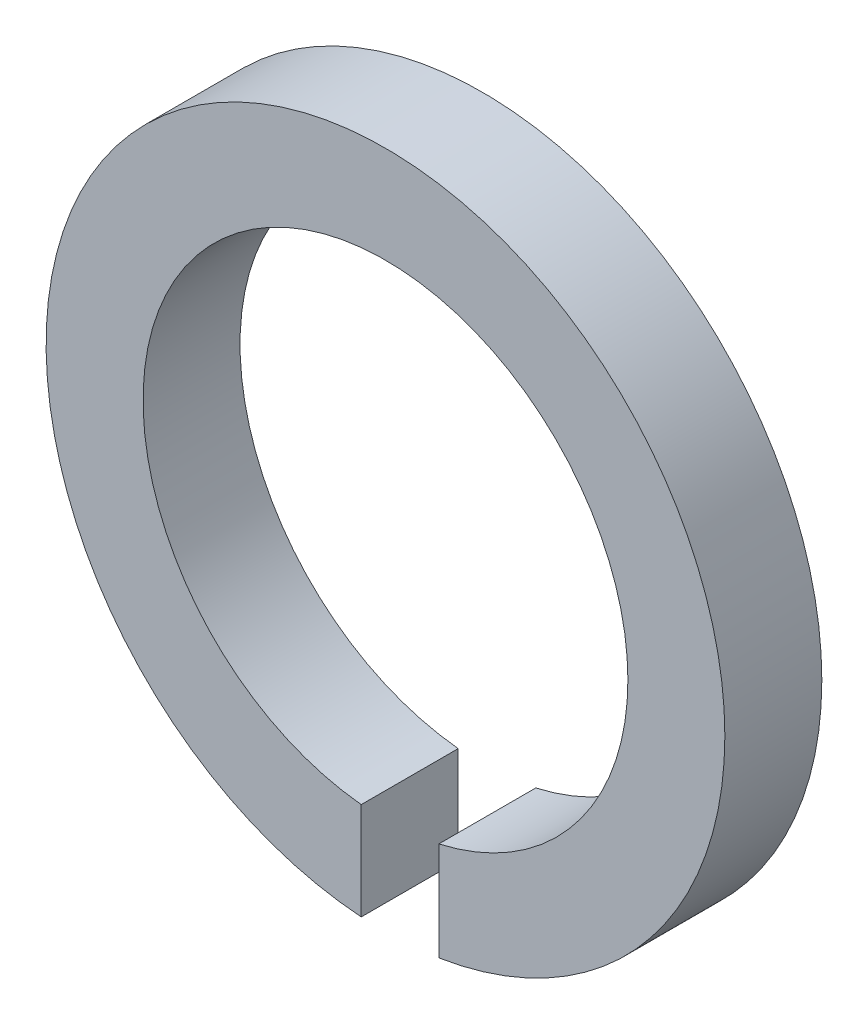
from build123d import *

# Parameters (mm, degrees)
SKETCH1_R          = 2.1
SKETCH1_R_2        = 1.5
BASE_EXTRUDE_DEPTH = 0.6
SKETCH2_W          = 0.48
SKETCH2_H          = 0.6
CUT_EXTRUDE1_DEPTH = 4.029851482


with BuildPart() as part:
    # Sketch1 → Base-Extrude (new body)
    with BuildSketch(Plane.XY):
        Circle(SKETCH1_R)
        Circle(SKETCH1_R_2, mode=Mode.SUBTRACT)
    extrude(amount=-BASE_EXTRUDE_DEPTH)

    # Sketch2 → Cut-Extrude1 (cut, through all)
    with BuildSketch(Plane(origin=(0, 0, 0), x_dir=(1, 0, 0), z_dir=(0, 1, 0))):
        with Locations((0.09, 0.3)):
            Rectangle(SKETCH2_W, SKETCH2_H)
    extrude(amount=-CUT_EXTRUDE1_DEPTH, mode=Mode.SUBTRACT)


solid = part.part
